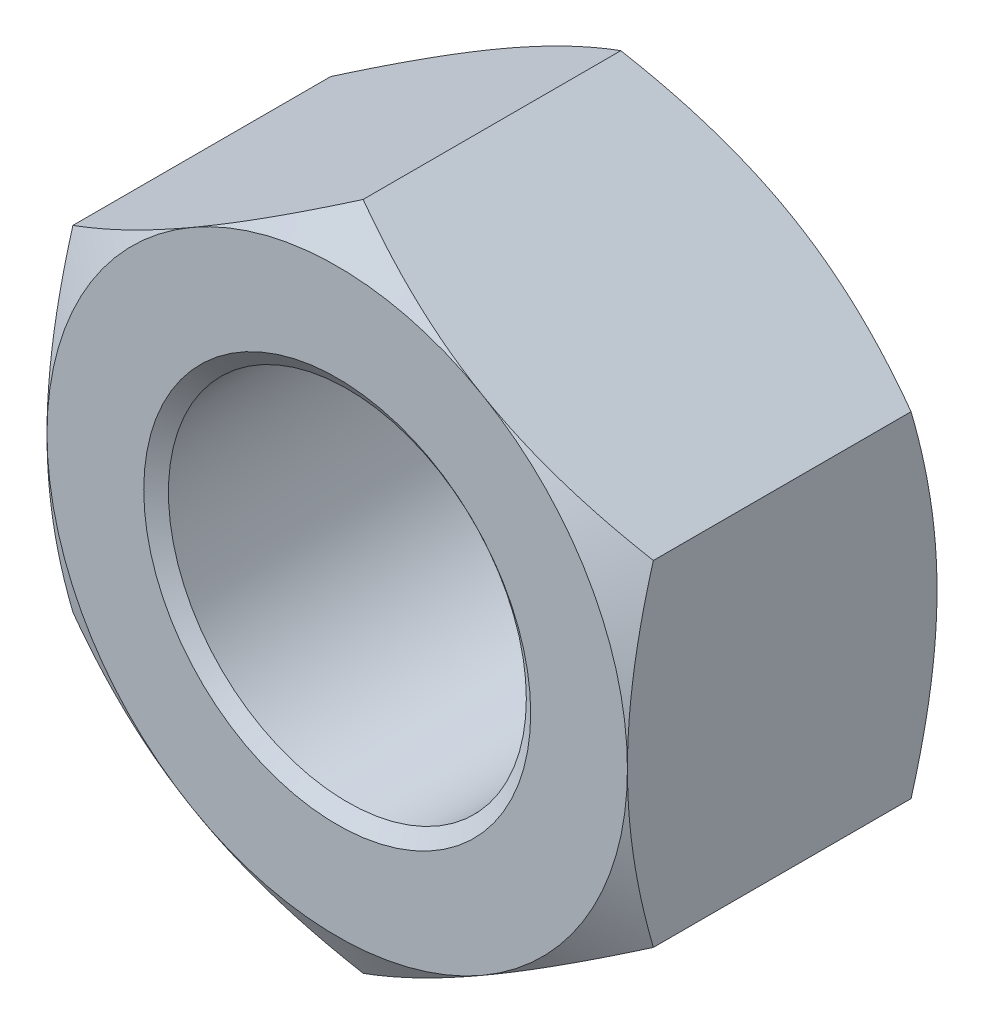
from build123d import *

# Parameters (mm, degrees)
BASENUTSKE_R  = 9.25
BASENUT_DEPTH = 16


with BuildPart() as part:
    # BaseNutSke → BaseNut (new body)
    with BuildSketch(Plane.XY):
        Polygon((15, 8.660254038), (15, -8.660254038), (0, -17.320508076), (-15, -8.660254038), (-15, 8.660254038), (0, 17.320508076), align=None)
        Circle(BASENUTSKE_R, mode=Mode.SUBTRACT)
    extrude(amount=-BASENUT_DEPTH)

    # Sketch3 → Double-Chamfer (revolve, cut)
    with BuildSketch(Plane(origin=(0, 0, 0), x_dir=(0, 0, -1), z_dir=(1, 0, 0))):
        Polygon((16, 15), (14.660254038, 17.320508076), (14.660254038, 27.320508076), (26, 27.320508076), (26, 15), align=None)
        Polygon((1.339745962, 27.320508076), (-10, 27.320508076), (-10, 15), (0, 15), (1.339745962, 17.320508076), align=None)
    revolve(axis=Axis((0, 0, 0), (0, 0, -1)), mode=Mode.SUBTRACT)

    # Sketch5 → EndChamfer (revolve, cut)
    with BuildSketch(Plane(origin=(0, 0, 0), x_dir=(0, 0, -1), z_dir=(1, 0, 0)), mode=Mode.PRIVATE) as endchamfer_sk:
        Polygon((15.9746, 10), (15.011814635, 8.625), (16.0254, 8.625), (16.0254, 10), align=None)
        Polygon((-0.0508, 10), (0, 10), (0.962785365, 8.625), (-0.0508, 8.625), align=None)
    revolve(endchamfer_sk.sketch.rotate(Axis((0, 0, -25.037505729), (0, 0, -1)), 90), axis=Axis((0, 0, -25.037505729), (0, 0, -1)), mode=Mode.SUBTRACT)


solid = part.part
